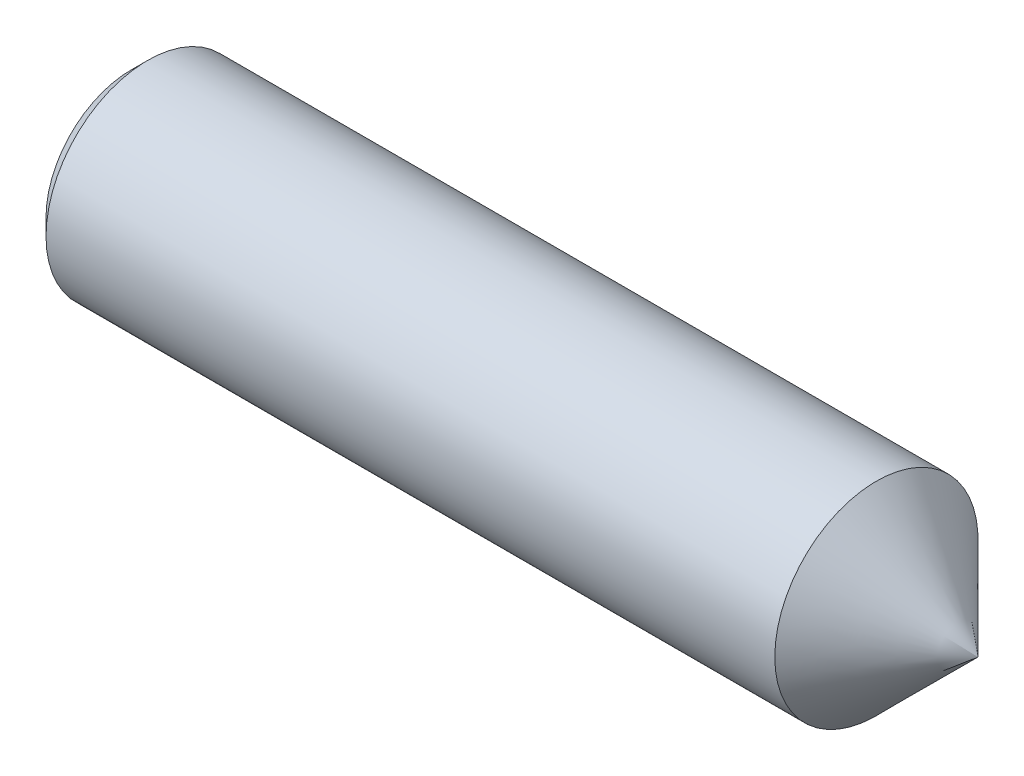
ISO-10303-21;
HEADER;
FILE_DESCRIPTION(('STEP AP214'),'2;1');
FILE_NAME('part.step','',(''),(''),'','','');
FILE_SCHEMA(('AUTOMOTIVE_DESIGN { 1 0 10303 214 1 1 1 1 }'));
ENDSEC;
DATA;
#1=APPLICATION_CONTEXT('core data for automotive mechanical design processes');
#2=APPLICATION_PROTOCOL_DEFINITION('international standard','automotive_design',2000,#1);
#3=PRODUCT_CONTEXT('',#1,'mechanical');
#4=PRODUCT('Part','Part','',(#3));
#5=PRODUCT_RELATED_PRODUCT_CATEGORY('part','',(#4));
#6=PRODUCT_DEFINITION_FORMATION('','',#4);
#7=PRODUCT_DEFINITION_CONTEXT('part definition',#1,'design');
#8=PRODUCT_DEFINITION('design','',#6,#7);
#9=PRODUCT_DEFINITION_SHAPE('','',#8);
#10=(LENGTH_UNIT() NAMED_UNIT(*) SI_UNIT(.MILLI.,.METRE.));
#11=(NAMED_UNIT(*) PLANE_ANGLE_UNIT() SI_UNIT($,.RADIAN.));
#12=(NAMED_UNIT(*) SI_UNIT($,.STERADIAN.) SOLID_ANGLE_UNIT());
#13=UNCERTAINTY_MEASURE_WITH_UNIT(LENGTH_MEASURE(1.E-05),#10,'distance_accuracy_value','');
#14=(GEOMETRIC_REPRESENTATION_CONTEXT(3) GLOBAL_UNCERTAINTY_ASSIGNED_CONTEXT((#13)) GLOBAL_UNIT_ASSIGNED_CONTEXT((#10,
#11,#12)) REPRESENTATION_CONTEXT('',''));
#15=CARTESIAN_POINT('',(0.,0.,0.));
#16=DIRECTION('',(0.,0.,1.));
#17=DIRECTION('',(1.,0.,0.));
#18=AXIS2_PLACEMENT_3D('',#15,#16,#17);
#19=CARTESIAN_POINT('',(0.,0.,0.));
#20=DIRECTION('',(1.,0.,0.));
#21=DIRECTION('',(0.,0.,-1.));
#22=AXIS2_PLACEMENT_3D('',#19,#20,#21);
#23=PLANE('',#22);
#24=CARTESIAN_POINT('',(0.,0.,0.));
#25=DIRECTION('',(-1.,0.,0.));
#26=DIRECTION('',(0.,0.,1.));
#27=AXIS2_PLACEMENT_3D('',#24,#25,#26);
#28=CIRCLE('',#27,5.036);
#29=CARTESIAN_POINT('',(0.,0.,5.036));
#30=VERTEX_POINT('',#29);
#31=EDGE_CURVE('E11',#30,#30,#28,.T.);
#32=ORIENTED_EDGE('',*,*,#31,.T.);
#33=EDGE_LOOP('',(#32));
#34=FACE_BOUND('',#33,.T.);
#35=DIRECTION('',(0.,0.5,0.866025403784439));
#36=VECTOR('',#35,1.);
#37=CARTESIAN_POINT('',(0.,1.73205080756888,-3.));
#38=LINE('',#37,#36);
#39=CARTESIAN_POINT('',(0.,1.73205080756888,-3.));
#40=VERTEX_POINT('',#39);
#41=CARTESIAN_POINT('',(0.,3.46410161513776,0.));
#42=VERTEX_POINT('',#41);
#43=EDGE_CURVE('E52',#40,#42,#38,.T.);
#44=ORIENTED_EDGE('',*,*,#43,.T.);
#45=DIRECTION('',(0.,-0.5,0.866025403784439));
#46=VECTOR('',#45,1.);
#47=CARTESIAN_POINT('',(0.,3.46410161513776,0.));
#48=LINE('',#47,#46);
#49=CARTESIAN_POINT('',(0.,1.73205080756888,3.));
#50=VERTEX_POINT('',#49);
#51=EDGE_CURVE('E121',#42,#50,#48,.T.);
#52=ORIENTED_EDGE('',*,*,#51,.T.);
#53=DIRECTION('',(0.,-1.,0.));
#54=VECTOR('',#53,1.);
#55=CARTESIAN_POINT('',(0.,1.73205080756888,3.));
#56=LINE('',#55,#54);
#57=CARTESIAN_POINT('',(0.,-1.73205080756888,3.));
#58=VERTEX_POINT('',#57);
#59=EDGE_CURVE('E126',#50,#58,#56,.T.);
#60=ORIENTED_EDGE('',*,*,#59,.T.);
#61=DIRECTION('',(0.,-0.5,-0.866025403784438));
#62=VECTOR('',#61,1.);
#63=CARTESIAN_POINT('',(0.,-1.73205080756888,3.));
#64=LINE('',#63,#62);
#65=CARTESIAN_POINT('',(0.,-3.46410161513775,0.));
#66=VERTEX_POINT('',#65);
#67=EDGE_CURVE('E127',#58,#66,#64,.T.);
#68=ORIENTED_EDGE('',*,*,#67,.T.);
#69=DIRECTION('',(0.,0.5,-0.866025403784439));
#70=VECTOR('',#69,1.);
#71=CARTESIAN_POINT('',(0.,-3.46410161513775,0.));
#72=LINE('',#71,#70);
#73=CARTESIAN_POINT('',(0.,-1.73205080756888,-3.));
#74=VERTEX_POINT('',#73);
#75=EDGE_CURVE('E112',#66,#74,#72,.T.);
#76=ORIENTED_EDGE('',*,*,#75,.T.);
#77=DIRECTION('',(0.,1.,0.));
#78=VECTOR('',#77,1.);
#79=CARTESIAN_POINT('',(0.,-1.73205080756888,-3.));
#80=LINE('',#79,#78);
#81=EDGE_CURVE('E133',#74,#40,#80,.T.);
#82=ORIENTED_EDGE('',*,*,#81,.T.);
#83=EDGE_LOOP('',(#44,#52,#60,#68,#76,#82));
#84=FACE_BOUND('',#83,.T.);
#85=ADVANCED_FACE('F39',(#34,#84),#23,.F.);
#86=CARTESIAN_POINT('',(0.964,0.,0.));
#87=DIRECTION('',(1.,0.,0.));
#88=DIRECTION('',(0.,0.,-1.));
#89=AXIS2_PLACEMENT_3D('',#86,#87,#88);
#90=CONICAL_SURFACE('',#89,6.,0.785398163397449);
#91=ORIENTED_EDGE('',*,*,#31,.F.);
#92=EDGE_LOOP('',(#91));
#93=FACE_BOUND('',#92,.T.);
#94=CARTESIAN_POINT('',(0.964,0.,0.));
#95=DIRECTION('',(-1.,0.,0.));
#96=DIRECTION('',(0.,0.,1.));
#97=AXIS2_PLACEMENT_3D('',#94,#95,#96);
#98=CIRCLE('',#97,6.);
#99=CARTESIAN_POINT('',(0.964,0.,6.));
#100=VERTEX_POINT('',#99);
#101=EDGE_CURVE('E46',#100,#100,#98,.T.);
#102=ORIENTED_EDGE('',*,*,#101,.T.);
#103=EDGE_LOOP('',(#102));
#104=FACE_BOUND('',#103,.T.);
#105=ADVANCED_FACE('F155',(#93,#104),#90,.T.);
#106=CARTESIAN_POINT('',(0.,0.,0.));
#107=DIRECTION('',(-1.,0.,0.));
#108=DIRECTION('',(0.,0.,1.));
#109=AXIS2_PLACEMENT_3D('',#106,#107,#108);
#110=CYLINDRICAL_SURFACE('',#109,6.);
#111=ORIENTED_EDGE('',*,*,#101,.F.);
#112=EDGE_LOOP('',(#111));
#113=FACE_BOUND('',#112,.T.);
#114=CARTESIAN_POINT('',(44.0004999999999,0.,0.));
#115=DIRECTION('',(-1.,0.,0.));
#116=DIRECTION('',(0.,0.,1.));
#117=AXIS2_PLACEMENT_3D('',#114,#115,#116);
#118=CIRCLE('',#117,6.);
#119=CARTESIAN_POINT('',(44.0004999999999,0.,5.99999999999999));
#120=VERTEX_POINT('',#119);
#121=EDGE_CURVE('E146',#120,#120,#118,.T.);
#122=ORIENTED_EDGE('',*,*,#121,.T.);
#123=EDGE_LOOP('',(#122));
#124=FACE_BOUND('',#123,.T.);
#125=ADVANCED_FACE('F154',(#113,#124),#110,.T.);
#126=CARTESIAN_POINT('',(50.,0.,0.));
#127=DIRECTION('',(-1.,0.,0.));
#128=DIRECTION('',(0.,0.,1.));
#129=AXIS2_PLACEMENT_3D('',#126,#127,#128);
#130=CONICAL_SURFACE('',#129,0.000499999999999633,0.785398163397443);
#131=CARTESIAN_POINT('',(50.,0.,0.));
#132=DIRECTION('',(-1.,0.,0.));
#133=DIRECTION('',(0.,0.,1.));
#134=AXIS2_PLACEMENT_3D('',#131,#132,#133);
#135=CIRCLE('',#134,0.000499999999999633);
#136=CARTESIAN_POINT('',(50.,0.,0.000499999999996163));
#137=VERTEX_POINT('',#136);
#138=EDGE_CURVE('E144',#137,#137,#135,.T.);
#139=CARTESIAN_POINT('',(44.0004999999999,0.,5.99999999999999));
#140=CARTESIAN_POINT('',(44.0629947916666,0.,5.93750520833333));
#141=CARTESIAN_POINT('',(44.1254895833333,0.,5.87501041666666));
#142=CARTESIAN_POINT('',(44.2504791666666,0.,5.75002083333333));
#143=CARTESIAN_POINT('',(44.3129739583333,0.,5.68752604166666));
#144=CARTESIAN_POINT('',(44.4379635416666,0.,5.56253645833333));
#145=CARTESIAN_POINT('',(44.5004583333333,0.,5.50004166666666));
#146=CARTESIAN_POINT('',(44.6254479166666,0.,5.37505208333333));
#147=CARTESIAN_POINT('',(44.6879427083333,0.,5.31255729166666));
#148=CARTESIAN_POINT('',(44.8129322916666,0.,5.18756770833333));
#149=CARTESIAN_POINT('',(44.8754270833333,0.,5.12507291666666));
#150=CARTESIAN_POINT('',(45.0004166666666,0.,5.00008333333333));
#151=CARTESIAN_POINT('',(45.0629114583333,0.,4.93758854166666));
#152=CARTESIAN_POINT('',(45.1879010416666,0.,4.81259895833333));
#153=CARTESIAN_POINT('',(45.2503958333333,0.,4.75010416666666));
#154=CARTESIAN_POINT('',(45.3753854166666,0.,4.62511458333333));
#155=CARTESIAN_POINT('',(45.4378802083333,0.,4.56261979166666));
#156=CARTESIAN_POINT('',(45.5628697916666,0.,4.43763020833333));
#157=CARTESIAN_POINT('',(45.6253645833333,0.,4.37513541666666));
#158=CARTESIAN_POINT('',(45.7503541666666,0.,4.25014583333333));
#159=CARTESIAN_POINT('',(45.8128489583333,0.,4.18765104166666));
#160=CARTESIAN_POINT('',(45.9378385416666,0.,4.06266145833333));
#161=CARTESIAN_POINT('',(46.0003333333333,0.,4.00016666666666));
#162=CARTESIAN_POINT('',(46.1253229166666,0.,3.87517708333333));
#163=CARTESIAN_POINT('',(46.1878177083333,0.,3.81268229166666));
#164=CARTESIAN_POINT('',(46.3128072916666,0.,3.68769270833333));
#165=CARTESIAN_POINT('',(46.3753020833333,0.,3.62519791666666));
#166=CARTESIAN_POINT('',(46.5002916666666,0.,3.50020833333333));
#167=CARTESIAN_POINT('',(46.5627864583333,0.,3.43771354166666));
#168=CARTESIAN_POINT('',(46.6877760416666,0.,3.31272395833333));
#169=CARTESIAN_POINT('',(46.7502708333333,0.,3.25022916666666));
#170=CARTESIAN_POINT('',(46.8752604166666,0.,3.12523958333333));
#171=CARTESIAN_POINT('',(46.9377552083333,0.,3.06274479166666));
#172=CARTESIAN_POINT('',(47.0627447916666,0.,2.93775520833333));
#173=CARTESIAN_POINT('',(47.1252395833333,0.,2.87526041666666));
#174=CARTESIAN_POINT('',(47.2502291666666,0.,2.75027083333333));
#175=CARTESIAN_POINT('',(47.3127239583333,0.,2.68777604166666));
#176=CARTESIAN_POINT('',(47.4377135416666,0.,2.56278645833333));
#177=CARTESIAN_POINT('',(47.5002083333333,0.,2.50029166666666));
#178=CARTESIAN_POINT('',(47.6251979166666,0.,2.37530208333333));
#179=CARTESIAN_POINT('',(47.6876927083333,0.,2.31280729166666));
#180=CARTESIAN_POINT('',(47.8126822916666,0.,2.18781770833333));
#181=CARTESIAN_POINT('',(47.8751770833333,0.,2.12532291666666));
#182=CARTESIAN_POINT('',(48.0001666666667,0.,2.00033333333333));
#183=CARTESIAN_POINT('',(48.0626614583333,0.,1.93783854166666));
#184=CARTESIAN_POINT('',(48.1876510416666,0.,1.81284895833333));
#185=CARTESIAN_POINT('',(48.2501458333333,0.,1.75035416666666));
#186=CARTESIAN_POINT('',(48.3751354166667,0.,1.62536458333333));
#187=CARTESIAN_POINT('',(48.4376302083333,0.,1.56286979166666));
#188=CARTESIAN_POINT('',(48.5626197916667,0.,1.43788020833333));
#189=CARTESIAN_POINT('',(48.6251145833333,0.,1.37538541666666));
#190=CARTESIAN_POINT('',(48.7501041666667,0.,1.25039583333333));
#191=CARTESIAN_POINT('',(48.8125989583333,0.,1.18790104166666));
#192=CARTESIAN_POINT('',(48.9375885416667,0.,1.06291145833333));
#193=CARTESIAN_POINT('',(49.0000833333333,0.,1.00041666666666));
#194=CARTESIAN_POINT('',(49.1250729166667,0.,0.875427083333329));
#195=CARTESIAN_POINT('',(49.1875677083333,0.,0.812932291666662));
#196=CARTESIAN_POINT('',(49.3125572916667,0.,0.68794270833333));
#197=CARTESIAN_POINT('',(49.3750520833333,0.,0.625447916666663));
#198=CARTESIAN_POINT('',(49.5000416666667,0.,0.50045833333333));
#199=CARTESIAN_POINT('',(49.5625364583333,0.,0.437963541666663));
#200=CARTESIAN_POINT('',(49.6875260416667,0.,0.312973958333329));
#201=CARTESIAN_POINT('',(49.7500208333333,0.,0.250479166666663));
#202=CARTESIAN_POINT('',(49.8750104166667,0.,0.125489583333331));
#203=CARTESIAN_POINT('',(49.9375052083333,0.,0.0629947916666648));
#204=CARTESIAN_POINT('',(50.,0.,0.000499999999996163));
#205=B_SPLINE_CURVE_WITH_KNOTS('',3,(#139,#140,#141,#142,#143,#144,#145,#146,#147,#148,#149,
#150,#151,#152,#153,#154,#155,#156,#157,#158,#159,#160,#161,#162,#163,#164,#165,#166,#167,#168,
#169,#170,#171,#172,#173,#174,#175,#176,#177,#178,#179,#180,#181,#182,#183,#184,#185,#186,#187,
#188,#189,#190,#191,#192,#193,#194,#195,#196,#197,#198,#199,#200,#201,#202,#203,#204),
.UNSPECIFIED.,.F.,.F.,(4,2,2,2,2,2,2,2,2,2,2,2,2,2,2,2,2,2,2,2,2,2,2,2,2,2,2,2,2,2,2,2,4),(0.,
0.265142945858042,0.530285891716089,0.79542883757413,1.06057178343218,1.32571472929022,
1.59085767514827,1.85600062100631,2.12114356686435,2.3862865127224,2.65142945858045,
2.91657240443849,3.18171535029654,3.44685829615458,3.71200124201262,3.97714418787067,
4.24228713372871,4.50743007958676,4.7725730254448,5.03771597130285,5.30285891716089,
5.56800186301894,5.83314480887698,6.09828775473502,6.36343070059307,6.62857364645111,
6.89371659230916,7.1588595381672,7.42400248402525,7.68914542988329,7.95428837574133,
8.21943132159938,8.48457426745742),.UNSPECIFIED.);
#206=EDGE_CURVE('BSEAM160',#120,#137,#205,.T.);
#207=ORIENTED_EDGE('',*,*,#121,.F.);
#208=ORIENTED_EDGE('',*,*,#138,.T.);
#209=ORIENTED_EDGE('',*,*,#206,.T.);
#210=ORIENTED_EDGE('',*,*,#206,.F.);
#211=EDGE_LOOP('',(#207,#209,#208,#210));
#212=FACE_BOUND('',#211,.T.);
#213=ADVANCED_FACE('F160',(#212),#130,.T.);
#214=CARTESIAN_POINT('',(50.,0.000499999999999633,0.));
#215=DIRECTION('',(-1.,0.,0.));
#216=DIRECTION('',(0.,0.,1.));
#217=AXIS2_PLACEMENT_3D('',#214,#215,#216);
#218=PLANE('',#217);
#219=ORIENTED_EDGE('',*,*,#138,.F.);
#220=EDGE_LOOP('',(#219));
#221=FACE_BOUND('',#220,.T.);
#222=ADVANCED_FACE('F161',(#221),#218,.F.);
#223=CARTESIAN_POINT('',(8.,1.73205080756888,-3.));
#224=DIRECTION('',(0.,-0.866025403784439,0.5));
#225=DIRECTION('',(0.,-0.5,-0.866025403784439));
#226=AXIS2_PLACEMENT_3D('',#223,#224,#225);
#227=PLANE('',#226);
#228=ORIENTED_EDGE('',*,*,#43,.F.);
#229=DIRECTION('',(-1.,0.,0.));
#230=VECTOR('',#229,1.);
#231=CARTESIAN_POINT('',(8.,1.73205080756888,-3.));
#232=LINE('',#231,#230);
#233=CARTESIAN_POINT('',(8.,1.73205080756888,-3.));
#234=VERTEX_POINT('',#233);
#235=EDGE_CURVE('E118',#234,#40,#232,.T.);
#236=ORIENTED_EDGE('',*,*,#235,.F.);
#237=DIRECTION('',(0.,0.5,0.866025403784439));
#238=VECTOR('',#237,1.);
#239=CARTESIAN_POINT('',(8.,1.73205080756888,-3.));
#240=LINE('',#239,#238);
#241=CARTESIAN_POINT('',(8.,3.46410161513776,0.));
#242=VERTEX_POINT('',#241);
#243=EDGE_CURVE('E138',#234,#242,#240,.T.);
#244=ORIENTED_EDGE('',*,*,#243,.T.);
#245=DIRECTION('',(-1.,0.,0.));
#246=VECTOR('',#245,1.);
#247=CARTESIAN_POINT('',(8.,3.46410161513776,0.));
#248=LINE('',#247,#246);
#249=EDGE_CURVE('E145',#242,#42,#248,.T.);
#250=ORIENTED_EDGE('',*,*,#249,.T.);
#251=EDGE_LOOP('',(#228,#236,#244,#250));
#252=FACE_BOUND('',#251,.T.);
#253=ADVANCED_FACE('F166',(#252),#227,.T.);
#254=CARTESIAN_POINT('',(8.,3.46410161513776,0.));
#255=DIRECTION('',(0.,-0.866025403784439,-0.5));
#256=DIRECTION('',(0.,0.5,-0.866025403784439));
#257=AXIS2_PLACEMENT_3D('',#254,#255,#256);
#258=PLANE('',#257);
#259=ORIENTED_EDGE('',*,*,#51,.F.);
#260=ORIENTED_EDGE('',*,*,#249,.F.);
#261=DIRECTION('',(0.,-0.5,0.866025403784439));
#262=VECTOR('',#261,1.);
#263=CARTESIAN_POINT('',(8.,3.46410161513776,0.));
#264=LINE('',#263,#262);
#265=CARTESIAN_POINT('',(8.,1.73205080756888,3.));
#266=VERTEX_POINT('',#265);
#267=EDGE_CURVE('E95',#242,#266,#264,.T.);
#268=ORIENTED_EDGE('',*,*,#267,.T.);
#269=DIRECTION('',(-1.,0.,0.));
#270=VECTOR('',#269,1.);
#271=CARTESIAN_POINT('',(8.,1.73205080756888,3.));
#272=LINE('',#271,#270);
#273=EDGE_CURVE('E139',#266,#50,#272,.T.);
#274=ORIENTED_EDGE('',*,*,#273,.T.);
#275=EDGE_LOOP('',(#259,#260,#268,#274));
#276=FACE_BOUND('',#275,.T.);
#277=ADVANCED_FACE('F172',(#276),#258,.T.);
#278=CARTESIAN_POINT('',(8.,1.73205080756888,3.));
#279=DIRECTION('',(0.,0.,-1.));
#280=DIRECTION('',(-1.,0.,0.));
#281=AXIS2_PLACEMENT_3D('',#278,#279,#280);
#282=PLANE('',#281);
#283=ORIENTED_EDGE('',*,*,#59,.F.);
#284=ORIENTED_EDGE('',*,*,#273,.F.);
#285=DIRECTION('',(0.,-1.,0.));
#286=VECTOR('',#285,1.);
#287=CARTESIAN_POINT('',(8.,1.73205080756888,3.));
#288=LINE('',#287,#286);
#289=CARTESIAN_POINT('',(8.,-1.73205080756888,3.));
#290=VERTEX_POINT('',#289);
#291=EDGE_CURVE('E109',#266,#290,#288,.T.);
#292=ORIENTED_EDGE('',*,*,#291,.T.);
#293=DIRECTION('',(-1.,0.,0.));
#294=VECTOR('',#293,1.);
#295=CARTESIAN_POINT('',(8.,-1.73205080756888,3.));
#296=LINE('',#295,#294);
#297=EDGE_CURVE('E110',#290,#58,#296,.T.);
#298=ORIENTED_EDGE('',*,*,#297,.T.);
#299=EDGE_LOOP('',(#283,#284,#292,#298));
#300=FACE_BOUND('',#299,.T.);
#301=ADVANCED_FACE('F188',(#300),#282,.T.);
#302=CARTESIAN_POINT('',(8.,-1.73205080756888,3.));
#303=DIRECTION('',(0.,0.866025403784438,-0.5));
#304=DIRECTION('',(0.,0.5,0.866025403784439));
#305=AXIS2_PLACEMENT_3D('',#302,#303,#304);
#306=PLANE('',#305);
#307=ORIENTED_EDGE('',*,*,#67,.F.);
#308=ORIENTED_EDGE('',*,*,#297,.F.);
#309=DIRECTION('',(0.,-0.5,-0.866025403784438));
#310=VECTOR('',#309,1.);
#311=CARTESIAN_POINT('',(8.,-1.73205080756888,3.));
#312=LINE('',#311,#310);
#313=CARTESIAN_POINT('',(8.,-3.46410161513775,0.));
#314=VERTEX_POINT('',#313);
#315=EDGE_CURVE('E105',#290,#314,#312,.T.);
#316=ORIENTED_EDGE('',*,*,#315,.T.);
#317=DIRECTION('',(-1.,0.,0.));
#318=VECTOR('',#317,1.);
#319=CARTESIAN_POINT('',(8.,-3.46410161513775,0.));
#320=LINE('',#319,#318);
#321=EDGE_CURVE('E106',#314,#66,#320,.T.);
#322=ORIENTED_EDGE('',*,*,#321,.T.);
#323=EDGE_LOOP('',(#307,#308,#316,#322));
#324=FACE_BOUND('',#323,.T.);
#325=ADVANCED_FACE('F102',(#324),#306,.T.);
#326=CARTESIAN_POINT('',(8.,-3.46410161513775,0.));
#327=DIRECTION('',(0.,0.866025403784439,0.5));
#328=DIRECTION('',(0.,-0.5,0.866025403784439));
#329=AXIS2_PLACEMENT_3D('',#326,#327,#328);
#330=PLANE('',#329);
#331=ORIENTED_EDGE('',*,*,#75,.F.);
#332=ORIENTED_EDGE('',*,*,#321,.F.);
#333=DIRECTION('',(0.,0.5,-0.866025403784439));
#334=VECTOR('',#333,1.);
#335=CARTESIAN_POINT('',(8.,-3.46410161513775,0.));
#336=LINE('',#335,#334);
#337=CARTESIAN_POINT('',(8.,-1.73205080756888,-3.));
#338=VERTEX_POINT('',#337);
#339=EDGE_CURVE('E107',#314,#338,#336,.T.);
#340=ORIENTED_EDGE('',*,*,#339,.T.);
#341=DIRECTION('',(-1.,0.,0.));
#342=VECTOR('',#341,1.);
#343=CARTESIAN_POINT('',(8.,-1.73205080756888,-3.));
#344=LINE('',#343,#342);
#345=EDGE_CURVE('E85',#338,#74,#344,.T.);
#346=ORIENTED_EDGE('',*,*,#345,.T.);
#347=EDGE_LOOP('',(#331,#332,#340,#346));
#348=FACE_BOUND('',#347,.T.);
#349=ADVANCED_FACE('F115',(#348),#330,.T.);
#350=CARTESIAN_POINT('',(8.,-1.73205080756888,-3.));
#351=DIRECTION('',(0.,0.,1.));
#352=DIRECTION('',(1.,0.,0.));
#353=AXIS2_PLACEMENT_3D('',#350,#351,#352);
#354=PLANE('',#353);
#355=ORIENTED_EDGE('',*,*,#81,.F.);
#356=ORIENTED_EDGE('',*,*,#345,.F.);
#357=DIRECTION('',(0.,1.,0.));
#358=VECTOR('',#357,1.);
#359=CARTESIAN_POINT('',(8.,-1.73205080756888,-3.));
#360=LINE('',#359,#358);
#361=EDGE_CURVE('E64',#338,#234,#360,.T.);
#362=ORIENTED_EDGE('',*,*,#361,.T.);
#363=ORIENTED_EDGE('',*,*,#235,.T.);
#364=EDGE_LOOP('',(#355,#356,#362,#363));
#365=FACE_BOUND('',#364,.T.);
#366=ADVANCED_FACE('F182',(#365),#354,.T.);
#367=CARTESIAN_POINT('',(8.,5.19615242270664,3.));
#368=DIRECTION('',(1.,0.,0.));
#369=DIRECTION('',(0.,0.,-1.));
#370=AXIS2_PLACEMENT_3D('',#367,#368,#369);
#371=PLANE('',#370);
#372=ORIENTED_EDGE('',*,*,#243,.F.);
#373=ORIENTED_EDGE('',*,*,#361,.F.);
#374=ORIENTED_EDGE('',*,*,#339,.F.);
#375=ORIENTED_EDGE('',*,*,#315,.F.);
#376=ORIENTED_EDGE('',*,*,#291,.F.);
#377=ORIENTED_EDGE('',*,*,#267,.F.);
#378=EDGE_LOOP('',(#372,#373,#374,#375,#376,#377));
#379=FACE_BOUND('',#378,.T.);
#380=ADVANCED_FACE('F120',(#379),#371,.F.);
#381=CLOSED_SHELL('',(#85,#105,#125,#213,#222,#253,#277,#301,#325,#349,#366,#380));
#382=MANIFOLD_SOLID_BREP('B2',#381);
#383=ADVANCED_BREP_SHAPE_REPRESENTATION('',(#18,#382),#14);
#384=SHAPE_DEFINITION_REPRESENTATION(#9,#383);
ENDSEC;
END-ISO-10303-21;
